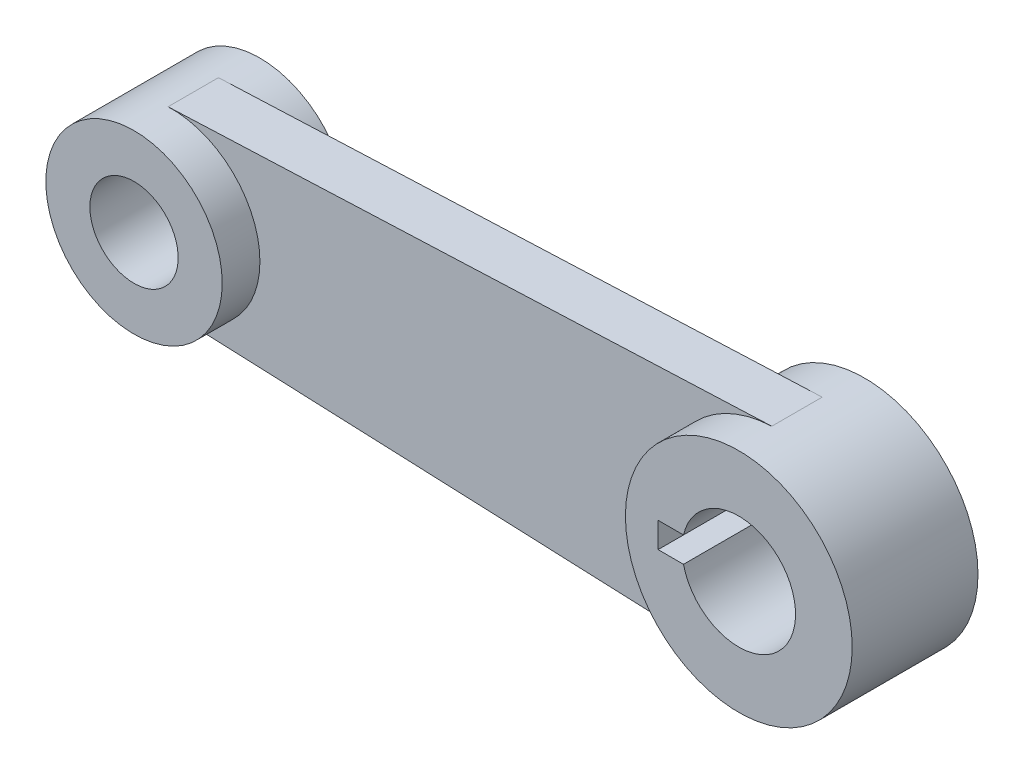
ISO-10303-21;
HEADER;
FILE_DESCRIPTION(('STEP AP214'),'2;1');
FILE_NAME('part.step','',(''),(''),'','','');
FILE_SCHEMA(('AUTOMOTIVE_DESIGN { 1 0 10303 214 1 1 1 1 }'));
ENDSEC;
DATA;
#1=APPLICATION_CONTEXT('core data for automotive mechanical design processes');
#2=APPLICATION_PROTOCOL_DEFINITION('international standard','automotive_design',2000,#1);
#3=PRODUCT_CONTEXT('',#1,'mechanical');
#4=PRODUCT('Part','Part','',(#3));
#5=PRODUCT_RELATED_PRODUCT_CATEGORY('part','',(#4));
#6=PRODUCT_DEFINITION_FORMATION('','',#4);
#7=PRODUCT_DEFINITION_CONTEXT('part definition',#1,'design');
#8=PRODUCT_DEFINITION('design','',#6,#7);
#9=PRODUCT_DEFINITION_SHAPE('','',#8);
#10=(LENGTH_UNIT() NAMED_UNIT(*) SI_UNIT(.MILLI.,.METRE.));
#11=(NAMED_UNIT(*) PLANE_ANGLE_UNIT() SI_UNIT($,.RADIAN.));
#12=(NAMED_UNIT(*) SI_UNIT($,.STERADIAN.) SOLID_ANGLE_UNIT());
#13=UNCERTAINTY_MEASURE_WITH_UNIT(LENGTH_MEASURE(1.E-05),#10,'distance_accuracy_value','');
#14=(GEOMETRIC_REPRESENTATION_CONTEXT(3) GLOBAL_UNCERTAINTY_ASSIGNED_CONTEXT((#13)) GLOBAL_UNIT_ASSIGNED_CONTEXT((#10,
#11,#12)) REPRESENTATION_CONTEXT('',''));
#15=CARTESIAN_POINT('',(0.,0.,0.));
#16=DIRECTION('',(0.,0.,1.));
#17=DIRECTION('',(1.,0.,0.));
#18=AXIS2_PLACEMENT_3D('',#15,#16,#17);
#19=CARTESIAN_POINT('',(-33.6209922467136,-12.897826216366,-3.175));
#20=DIRECTION('',(-0.0416666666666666,-0.999131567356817,0.));
#21=DIRECTION('',(0.999131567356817,-0.0416666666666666,0.));
#22=AXIS2_PLACEMENT_3D('',#19,#20,#21);
#23=PLANE('',#22);
#24=DIRECTION('',(0.999131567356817,-0.0416666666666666,0.));
#25=VECTOR('',#24,1.);
#26=CARTESIAN_POINT('',(-33.6209922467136,-12.897826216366,3.175));
#27=LINE('',#26,#25);
#28=CARTESIAN_POINT('',(-76.6630208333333,-11.1028495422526,3.175));
#29=VERTEX_POINT('',#28);
#30=CARTESIAN_POINT('',(-0.595312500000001,-14.2750922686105,3.175));
#31=VERTEX_POINT('',#30);
#32=EDGE_CURVE('E116',#29,#31,#27,.T.);
#33=ORIENTED_EDGE('',*,*,#32,.F.);
#34=DIRECTION('',(0.,0.,1.));
#35=VECTOR('',#34,1.);
#36=CARTESIAN_POINT('',(-76.6630208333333,-11.1028495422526,-3.175));
#37=LINE('',#36,#35);
#38=CARTESIAN_POINT('',(-76.6630208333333,-11.1028495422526,-3.17499999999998));
#39=VERTEX_POINT('',#38);
#40=EDGE_CURVE('E54',#39,#29,#37,.T.);
#41=ORIENTED_EDGE('',*,*,#40,.F.);
#42=DIRECTION('',(0.999131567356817,-0.0416666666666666,0.));
#43=VECTOR('',#42,1.);
#44=CARTESIAN_POINT('',(-33.6209922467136,-12.897826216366,-3.175));
#45=LINE('',#44,#43);
#46=CARTESIAN_POINT('',(-0.5953125,-14.2750922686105,-3.17499999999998));
#47=VERTEX_POINT('',#46);
#48=EDGE_CURVE('E137',#39,#47,#45,.T.);
#49=ORIENTED_EDGE('',*,*,#48,.T.);
#50=DIRECTION('',(0.,0.,1.));
#51=VECTOR('',#50,1.);
#52=CARTESIAN_POINT('',(-0.5953125,-14.2750922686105,-3.175));
#53=LINE('',#52,#51);
#54=EDGE_CURVE('E14',#47,#31,#53,.T.);
#55=ORIENTED_EDGE('',*,*,#54,.T.);
#56=EDGE_LOOP('',(#33,#41,#49,#55));
#57=FACE_BOUND('',#56,.T.);
#58=ADVANCED_FACE('F45',(#57),#23,.T.);
#59=CARTESIAN_POINT('',(-40.4678532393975,12.612292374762,-3.175));
#60=DIRECTION('',(0.0416666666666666,-0.999131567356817,0.));
#61=DIRECTION('',(0.999131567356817,0.0416666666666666,0.));
#62=AXIS2_PLACEMENT_3D('',#59,#60,#61);
#63=PLANE('',#62);
#64=DIRECTION('',(0.999131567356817,0.0416666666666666,0.));
#65=VECTOR('',#64,1.);
#66=CARTESIAN_POINT('',(-40.4678532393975,12.612292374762,3.175));
#67=LINE('',#66,#65);
#68=CARTESIAN_POINT('',(-76.6630208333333,11.1028495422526,3.175));
#69=VERTEX_POINT('',#68);
#70=CARTESIAN_POINT('',(-0.5953125,14.2750922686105,3.175));
#71=VERTEX_POINT('',#70);
#72=EDGE_CURVE('E117',#69,#71,#67,.T.);
#73=ORIENTED_EDGE('',*,*,#72,.T.);
#74=DIRECTION('',(0.,0.,1.));
#75=VECTOR('',#74,1.);
#76=CARTESIAN_POINT('',(-0.5953125,14.2750922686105,-3.175));
#77=LINE('',#76,#75);
#78=CARTESIAN_POINT('',(-0.5953125,14.2750922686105,-3.17499999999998));
#79=VERTEX_POINT('',#78);
#80=EDGE_CURVE('E49',#79,#71,#77,.T.);
#81=ORIENTED_EDGE('',*,*,#80,.F.);
#82=DIRECTION('',(0.999131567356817,0.0416666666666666,0.));
#83=VECTOR('',#82,1.);
#84=CARTESIAN_POINT('',(-40.4678532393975,12.612292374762,-3.175));
#85=LINE('',#84,#83);
#86=CARTESIAN_POINT('',(-76.6630208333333,11.1028495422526,-3.17499999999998));
#87=VERTEX_POINT('',#86);
#88=EDGE_CURVE('E122',#87,#79,#85,.T.);
#89=ORIENTED_EDGE('',*,*,#88,.F.);
#90=DIRECTION('',(0.,0.,1.));
#91=VECTOR('',#90,1.);
#92=CARTESIAN_POINT('',(-76.6630208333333,11.1028495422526,-3.175));
#93=LINE('',#92,#91);
#94=EDGE_CURVE('E110',#87,#69,#93,.T.);
#95=ORIENTED_EDGE('',*,*,#94,.T.);
#96=EDGE_LOOP('',(#73,#81,#89,#95));
#97=FACE_BOUND('',#96,.T.);
#98=ADVANCED_FACE('F47',(#97),#63,.F.);
#99=CARTESIAN_POINT('',(-36.5125,-82.2337463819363,-3.175));
#100=DIRECTION('',(0.,0.,1.));
#101=DIRECTION('',(1.,0.,0.));
#102=AXIS2_PLACEMENT_3D('',#99,#100,#101);
#103=PLANE('',#102);
#104=CARTESIAN_POINT('',(0.,0.,-3.175));
#105=DIRECTION('',(0.,0.,1.));
#106=DIRECTION('',(1.,0.,0.));
#107=AXIS2_PLACEMENT_3D('',#104,#105,#106);
#108=CIRCLE('',#107,14.2875);
#109=EDGE_CURVE('E132',#47,#79,#108,.F.);
#110=ORIENTED_EDGE('',*,*,#109,.F.);
#111=ORIENTED_EDGE('',*,*,#48,.F.);
#112=CARTESIAN_POINT('',(-76.2,0.,-3.175));
#113=DIRECTION('',(0.,0.,1.));
#114=DIRECTION('',(1.,0.,0.));
#115=AXIS2_PLACEMENT_3D('',#112,#113,#114);
#116=CIRCLE('',#115,11.1125);
#117=EDGE_CURVE('E135',#87,#39,#116,.F.);
#118=ORIENTED_EDGE('',*,*,#117,.F.);
#119=ORIENTED_EDGE('',*,*,#88,.T.);
#120=EDGE_LOOP('',(#110,#111,#118,#119));
#121=FACE_BOUND('',#120,.T.);
#122=ADVANCED_FACE('F144',(#121),#103,.F.);
#123=CARTESIAN_POINT('',(-36.5125,-82.2337463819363,3.175));
#124=DIRECTION('',(0.,0.,1.));
#125=DIRECTION('',(1.,0.,0.));
#126=AXIS2_PLACEMENT_3D('',#123,#124,#125);
#127=PLANE('',#126);
#128=CARTESIAN_POINT('',(0.,0.,3.175));
#129=DIRECTION('',(0.,0.,1.));
#130=DIRECTION('',(1.,0.,0.));
#131=AXIS2_PLACEMENT_3D('',#128,#129,#130);
#132=CIRCLE('',#131,14.2875);
#133=EDGE_CURVE('E125',#31,#71,#132,.F.);
#134=ORIENTED_EDGE('',*,*,#133,.T.);
#135=ORIENTED_EDGE('',*,*,#72,.F.);
#136=CARTESIAN_POINT('',(-76.2,0.,3.175));
#137=DIRECTION('',(0.,0.,1.));
#138=DIRECTION('',(1.,0.,0.));
#139=AXIS2_PLACEMENT_3D('',#136,#137,#138);
#140=CIRCLE('',#139,11.1125);
#141=EDGE_CURVE('E107',#69,#29,#140,.F.);
#142=ORIENTED_EDGE('',*,*,#141,.T.);
#143=ORIENTED_EDGE('',*,*,#32,.T.);
#144=EDGE_LOOP('',(#134,#135,#142,#143));
#145=FACE_BOUND('',#144,.T.);
#146=ADVANCED_FACE('F124',(#145),#127,.T.);
#147=CARTESIAN_POINT('',(0.,0.,53.0857525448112));
#148=DIRECTION('',(0.,0.,-1.));
#149=DIRECTION('',(-1.,0.,0.));
#150=AXIS2_PLACEMENT_3D('',#147,#148,#149);
#151=CYLINDRICAL_SURFACE('',#150,14.2875);
#152=CARTESIAN_POINT('',(0.,0.,-7.9248));
#153=DIRECTION('',(0.,0.,1.));
#154=DIRECTION('',(1.,0.,0.));
#155=AXIS2_PLACEMENT_3D('',#152,#153,#154);
#156=CIRCLE('',#155,14.2875);
#157=CARTESIAN_POINT('',(14.2875,0.,-7.9248));
#158=VERTEX_POINT('',#157);
#159=EDGE_CURVE('E294',#158,#158,#156,.T.);
#160=ORIENTED_EDGE('',*,*,#159,.T.);
#161=EDGE_LOOP('',(#160));
#162=FACE_BOUND('',#161,.T.);
#163=CARTESIAN_POINT('',(0.,0.,7.9248));
#164=DIRECTION('',(0.,0.,1.));
#165=DIRECTION('',(1.,0.,0.));
#166=AXIS2_PLACEMENT_3D('',#163,#164,#165);
#167=CIRCLE('',#166,14.2875);
#168=CARTESIAN_POINT('',(14.2875,0.,7.9248));
#169=VERTEX_POINT('',#168);
#170=EDGE_CURVE('E314',#169,#169,#167,.F.);
#171=ORIENTED_EDGE('',*,*,#170,.T.);
#172=EDGE_LOOP('',(#171));
#173=FACE_BOUND('',#172,.T.);
#174=ORIENTED_EDGE('',*,*,#109,.T.);
#175=ORIENTED_EDGE('',*,*,#80,.T.);
#176=ORIENTED_EDGE('',*,*,#133,.F.);
#177=ORIENTED_EDGE('',*,*,#54,.F.);
#178=EDGE_LOOP('',(#174,#175,#176,#177));
#179=FACE_BOUND('',#178,.T.);
#180=ADVANCED_FACE('F145',(#162,#173,#179),#151,.T.);
#181=CARTESIAN_POINT('',(-10.1691366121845,-82.2337463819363,53.0857525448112));
#182=DIRECTION('',(1.,0.,0.));
#183=DIRECTION('',(0.,0.,-1.));
#184=AXIS2_PLACEMENT_3D('',#181,#182,#183);
#185=PLANE('',#184);
#186=DIRECTION('',(0.,0.,-1.));
#187=VECTOR('',#186,1.);
#188=CARTESIAN_POINT('',(-10.1691366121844,1.6002,53.0857525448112));
#189=LINE('',#188,#187);
#190=CARTESIAN_POINT('',(-10.1691366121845,1.6002,7.9248));
#191=VERTEX_POINT('',#190);
#192=CARTESIAN_POINT('',(-10.1691366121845,1.6002,-7.9248));
#193=VERTEX_POINT('',#192);
#194=EDGE_CURVE('E317',#191,#193,#189,.T.);
#195=ORIENTED_EDGE('',*,*,#194,.F.);
#196=DIRECTION('',(0.,-1.,0.));
#197=VECTOR('',#196,1.);
#198=CARTESIAN_POINT('',(-10.1691366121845,-82.2337463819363,7.9248));
#199=LINE('',#198,#197);
#200=CARTESIAN_POINT('',(-10.1691366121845,-1.6002,7.92480000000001));
#201=VERTEX_POINT('',#200);
#202=EDGE_CURVE('E127',#191,#201,#199,.T.);
#203=ORIENTED_EDGE('',*,*,#202,.T.);
#204=DIRECTION('',(0.,0.,-1.));
#205=VECTOR('',#204,1.);
#206=CARTESIAN_POINT('',(-10.1691366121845,-1.6002,53.0857525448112));
#207=LINE('',#206,#205);
#208=CARTESIAN_POINT('',(-10.1691366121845,-1.6002,-7.9248));
#209=VERTEX_POINT('',#208);
#210=EDGE_CURVE('E319',#201,#209,#207,.T.);
#211=ORIENTED_EDGE('',*,*,#210,.T.);
#212=DIRECTION('',(0.,1.,0.));
#213=VECTOR('',#212,1.);
#214=CARTESIAN_POINT('',(-10.1691366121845,-82.2337463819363,-7.9248));
#215=LINE('',#214,#213);
#216=EDGE_CURVE('E297',#209,#193,#215,.T.);
#217=ORIENTED_EDGE('',*,*,#216,.T.);
#218=EDGE_LOOP('',(#195,#203,#211,#217));
#219=FACE_BOUND('',#218,.T.);
#220=ADVANCED_FACE('F147',(#219),#185,.T.);
#221=CARTESIAN_POINT('',(-36.5125,-1.6002,53.0857525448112));
#222=DIRECTION('',(0.,-1.,0.));
#223=DIRECTION('',(0.,0.,-1.));
#224=AXIS2_PLACEMENT_3D('',#221,#222,#223);
#225=PLANE('',#224);
#226=DIRECTION('',(-1.,0.,0.));
#227=VECTOR('',#226,1.);
#228=CARTESIAN_POINT('',(-36.5125,-1.6002,7.9248));
#229=LINE('',#228,#227);
#230=CARTESIAN_POINT('',(-6.96873661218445,-1.6002,7.9248));
#231=VERTEX_POINT('',#230);
#232=EDGE_CURVE('E301',#231,#201,#229,.T.);
#233=ORIENTED_EDGE('',*,*,#232,.F.);
#234=DIRECTION('',(0.,0.,-1.));
#235=VECTOR('',#234,1.);
#236=CARTESIAN_POINT('',(-6.96873661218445,-1.6002,53.0857525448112));
#237=LINE('',#236,#235);
#238=CARTESIAN_POINT('',(-6.96873661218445,-1.6002,-7.92480000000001));
#239=VERTEX_POINT('',#238);
#240=EDGE_CURVE('E321',#231,#239,#237,.T.);
#241=ORIENTED_EDGE('',*,*,#240,.T.);
#242=DIRECTION('',(1.,0.,0.));
#243=VECTOR('',#242,1.);
#244=CARTESIAN_POINT('',(-36.5125,-1.6002,-7.9248));
#245=LINE('',#244,#243);
#246=EDGE_CURVE('E296',#209,#239,#245,.T.);
#247=ORIENTED_EDGE('',*,*,#246,.F.);
#248=ORIENTED_EDGE('',*,*,#210,.F.);
#249=EDGE_LOOP('',(#233,#241,#247,#248));
#250=FACE_BOUND('',#249,.T.);
#251=ADVANCED_FACE('F154',(#250),#225,.F.);
#252=CARTESIAN_POINT('',(0.,0.,53.0857525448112));
#253=DIRECTION('',(0.,0.,-1.));
#254=DIRECTION('',(-1.,0.,0.));
#255=AXIS2_PLACEMENT_3D('',#252,#253,#254);
#256=CYLINDRICAL_SURFACE('',#255,7.1501);
#257=CARTESIAN_POINT('',(0.,0.,7.9248));
#258=DIRECTION('',(0.,0.,1.));
#259=DIRECTION('',(1.,0.,0.));
#260=AXIS2_PLACEMENT_3D('',#257,#258,#259);
#261=CIRCLE('',#260,7.1501);
#262=CARTESIAN_POINT('',(-6.96873661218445,1.6002,7.9248));
#263=VERTEX_POINT('',#262);
#264=EDGE_CURVE('E309',#263,#231,#261,.F.);
#265=ORIENTED_EDGE('',*,*,#264,.F.);
#266=DIRECTION('',(0.,0.,-1.));
#267=VECTOR('',#266,1.);
#268=CARTESIAN_POINT('',(-6.96873661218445,1.6002,53.0857525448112));
#269=LINE('',#268,#267);
#270=CARTESIAN_POINT('',(-6.96873661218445,1.6002,-7.9248));
#271=VERTEX_POINT('',#270);
#272=EDGE_CURVE('E323',#263,#271,#269,.T.);
#273=ORIENTED_EDGE('',*,*,#272,.T.);
#274=CARTESIAN_POINT('',(0.,0.,-7.9248));
#275=DIRECTION('',(0.,0.,1.));
#276=DIRECTION('',(1.,0.,0.));
#277=AXIS2_PLACEMENT_3D('',#274,#275,#276);
#278=CIRCLE('',#277,7.1501);
#279=EDGE_CURVE('E298',#239,#271,#278,.T.);
#280=ORIENTED_EDGE('',*,*,#279,.F.);
#281=ORIENTED_EDGE('',*,*,#240,.F.);
#282=EDGE_LOOP('',(#265,#273,#280,#281));
#283=FACE_BOUND('',#282,.T.);
#284=ADVANCED_FACE('F195',(#283),#256,.F.);
#285=CARTESIAN_POINT('',(-36.5125,1.6002,53.0857525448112));
#286=DIRECTION('',(0.,-1.,0.));
#287=DIRECTION('',(0.,0.,-1.));
#288=AXIS2_PLACEMENT_3D('',#285,#286,#287);
#289=PLANE('',#288);
#290=ORIENTED_EDGE('',*,*,#272,.F.);
#291=DIRECTION('',(-1.,0.,0.));
#292=VECTOR('',#291,1.);
#293=CARTESIAN_POINT('',(-36.5125,1.6002,7.9248));
#294=LINE('',#293,#292);
#295=EDGE_CURVE('E311',#263,#191,#294,.T.);
#296=ORIENTED_EDGE('',*,*,#295,.T.);
#297=ORIENTED_EDGE('',*,*,#194,.T.);
#298=DIRECTION('',(1.,0.,0.));
#299=VECTOR('',#298,1.);
#300=CARTESIAN_POINT('',(-36.5125,1.6002,-7.9248));
#301=LINE('',#300,#299);
#302=EDGE_CURVE('E292',#193,#271,#301,.T.);
#303=ORIENTED_EDGE('',*,*,#302,.T.);
#304=EDGE_LOOP('',(#290,#296,#297,#303));
#305=FACE_BOUND('',#304,.T.);
#306=ADVANCED_FACE('F205',(#305),#289,.T.);
#307=CARTESIAN_POINT('',(-36.5125,-82.2337463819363,7.9248));
#308=DIRECTION('',(0.,0.,1.));
#309=DIRECTION('',(1.,0.,0.));
#310=AXIS2_PLACEMENT_3D('',#307,#308,#309);
#311=PLANE('',#310);
#312=ORIENTED_EDGE('',*,*,#170,.F.);
#313=EDGE_LOOP('',(#312));
#314=FACE_BOUND('',#313,.T.);
#315=ORIENTED_EDGE('',*,*,#295,.F.);
#316=ORIENTED_EDGE('',*,*,#264,.T.);
#317=ORIENTED_EDGE('',*,*,#232,.T.);
#318=ORIENTED_EDGE('',*,*,#202,.F.);
#319=EDGE_LOOP('',(#315,#316,#317,#318));
#320=FACE_BOUND('',#319,.T.);
#321=ADVANCED_FACE('F215',(#314,#320),#311,.T.);
#322=CARTESIAN_POINT('',(-36.5125,-82.2337463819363,-7.9248));
#323=DIRECTION('',(0.,0.,1.));
#324=DIRECTION('',(1.,0.,0.));
#325=AXIS2_PLACEMENT_3D('',#322,#323,#324);
#326=PLANE('',#325);
#327=ORIENTED_EDGE('',*,*,#216,.F.);
#328=ORIENTED_EDGE('',*,*,#246,.T.);
#329=ORIENTED_EDGE('',*,*,#279,.T.);
#330=ORIENTED_EDGE('',*,*,#302,.F.);
#331=EDGE_LOOP('',(#327,#328,#329,#330));
#332=FACE_BOUND('',#331,.T.);
#333=ORIENTED_EDGE('',*,*,#159,.F.);
#334=EDGE_LOOP('',(#333));
#335=FACE_BOUND('',#334,.T.);
#336=ADVANCED_FACE('F224',(#332,#335),#326,.F.);
#337=CARTESIAN_POINT('',(-76.2,0.,53.0857525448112));
#338=DIRECTION('',(0.,0.,-1.));
#339=DIRECTION('',(-1.,0.,0.));
#340=AXIS2_PLACEMENT_3D('',#337,#338,#339);
#341=CYLINDRICAL_SURFACE('',#340,11.1125);
#342=CARTESIAN_POINT('',(-76.2,0.,-7.9248));
#343=DIRECTION('',(0.,0.,1.));
#344=DIRECTION('',(1.,0.,0.));
#345=AXIS2_PLACEMENT_3D('',#342,#343,#344);
#346=CIRCLE('',#345,11.1125);
#347=CARTESIAN_POINT('',(-65.0875,0.,-7.9248));
#348=VERTEX_POINT('',#347);
#349=EDGE_CURVE('E283',#348,#348,#346,.T.);
#350=ORIENTED_EDGE('',*,*,#349,.T.);
#351=EDGE_LOOP('',(#350));
#352=FACE_BOUND('',#351,.T.);
#353=CARTESIAN_POINT('',(-76.2,0.,7.9248));
#354=DIRECTION('',(0.,0.,1.));
#355=DIRECTION('',(1.,0.,0.));
#356=AXIS2_PLACEMENT_3D('',#353,#354,#355);
#357=CIRCLE('',#356,11.1125);
#358=CARTESIAN_POINT('',(-65.0875,0.,7.9248));
#359=VERTEX_POINT('',#358);
#360=EDGE_CURVE('E284',#359,#359,#357,.F.);
#361=ORIENTED_EDGE('',*,*,#360,.T.);
#362=EDGE_LOOP('',(#361));
#363=FACE_BOUND('',#362,.T.);
#364=ORIENTED_EDGE('',*,*,#117,.T.);
#365=ORIENTED_EDGE('',*,*,#40,.T.);
#366=ORIENTED_EDGE('',*,*,#141,.F.);
#367=ORIENTED_EDGE('',*,*,#94,.F.);
#368=EDGE_LOOP('',(#364,#365,#366,#367));
#369=FACE_BOUND('',#368,.T.);
#370=ADVANCED_FACE('F109',(#352,#363,#369),#341,.T.);
#371=CARTESIAN_POINT('',(-76.2,0.,53.0857525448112));
#372=DIRECTION('',(0.,0.,-1.));
#373=DIRECTION('',(-1.,0.,0.));
#374=AXIS2_PLACEMENT_3D('',#371,#372,#373);
#375=CYLINDRICAL_SURFACE('',#374,5.5626);
#376=CARTESIAN_POINT('',(-76.2,0.,7.9248));
#377=DIRECTION('',(0.,0.,1.));
#378=DIRECTION('',(1.,0.,0.));
#379=AXIS2_PLACEMENT_3D('',#376,#377,#378);
#380=CIRCLE('',#379,5.5626);
#381=CARTESIAN_POINT('',(-81.7626,0.,7.92479999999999));
#382=VERTEX_POINT('',#381);
#383=EDGE_CURVE('E287',#382,#382,#380,.F.);
#384=CARTESIAN_POINT('',(-76.2,0.,-7.9248));
#385=DIRECTION('',(0.,0.,1.));
#386=DIRECTION('',(1.,0.,0.));
#387=AXIS2_PLACEMENT_3D('',#384,#385,#386);
#388=CIRCLE('',#387,5.5626);
#389=CARTESIAN_POINT('',(-81.7626,0.,-7.9248));
#390=VERTEX_POINT('',#389);
#391=EDGE_CURVE('E280',#390,#390,#388,.T.);
#392=CARTESIAN_POINT('',(-81.7626,0.,7.92479999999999));
#393=CARTESIAN_POINT('',(-81.7626,0.,7.75969999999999));
#394=CARTESIAN_POINT('',(-81.7626,0.,7.59459999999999));
#395=CARTESIAN_POINT('',(-81.7626,0.,7.26439999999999));
#396=CARTESIAN_POINT('',(-81.7626,0.,7.09929999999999));
#397=CARTESIAN_POINT('',(-81.7626,0.,6.76909999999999));
#398=CARTESIAN_POINT('',(-81.7626,0.,6.60399999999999));
#399=CARTESIAN_POINT('',(-81.7626,0.,6.27379999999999));
#400=CARTESIAN_POINT('',(-81.7626,0.,6.10869999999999));
#401=CARTESIAN_POINT('',(-81.7626,0.,5.77849999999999));
#402=CARTESIAN_POINT('',(-81.7626,0.,5.61339999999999));
#403=CARTESIAN_POINT('',(-81.7626,0.,5.28319999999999));
#404=CARTESIAN_POINT('',(-81.7626,0.,5.11809999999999));
#405=CARTESIAN_POINT('',(-81.7626,0.,4.78789999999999));
#406=CARTESIAN_POINT('',(-81.7626,0.,4.62279999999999));
#407=CARTESIAN_POINT('',(-81.7626,0.,4.29259999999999));
#408=CARTESIAN_POINT('',(-81.7626,0.,4.12749999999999));
#409=CARTESIAN_POINT('',(-81.7626,0.,3.79729999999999));
#410=CARTESIAN_POINT('',(-81.7626,0.,3.63219999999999));
#411=CARTESIAN_POINT('',(-81.7626,0.,3.30199999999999));
#412=CARTESIAN_POINT('',(-81.7626,0.,3.13689999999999));
#413=CARTESIAN_POINT('',(-81.7626,0.,2.80669999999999));
#414=CARTESIAN_POINT('',(-81.7626,0.,2.64159999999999));
#415=CARTESIAN_POINT('',(-81.7626,0.,2.31139999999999));
#416=CARTESIAN_POINT('',(-81.7626,0.,2.14629999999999));
#417=CARTESIAN_POINT('',(-81.7626,0.,1.81609999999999));
#418=CARTESIAN_POINT('',(-81.7626,0.,1.65099999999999));
#419=CARTESIAN_POINT('',(-81.7626,0.,1.32079999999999));
#420=CARTESIAN_POINT('',(-81.7626,0.,1.15569999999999));
#421=CARTESIAN_POINT('',(-81.7626,0.,0.825499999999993));
#422=CARTESIAN_POINT('',(-81.7626,0.,0.660399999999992));
#423=CARTESIAN_POINT('',(-81.7626,0.,0.330199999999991));
#424=CARTESIAN_POINT('',(-81.7626,0.,0.165099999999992));
#425=CARTESIAN_POINT('',(-81.7626,0.,-0.165100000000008));
#426=CARTESIAN_POINT('',(-81.7626,0.,-0.33020000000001));
#427=CARTESIAN_POINT('',(-81.7626,0.,-0.66040000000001));
#428=CARTESIAN_POINT('',(-81.7626,0.,-0.825500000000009));
#429=CARTESIAN_POINT('',(-81.7626,0.,-1.15570000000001));
#430=CARTESIAN_POINT('',(-81.7626,0.,-1.32080000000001));
#431=CARTESIAN_POINT('',(-81.7626,0.,-1.65100000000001));
#432=CARTESIAN_POINT('',(-81.7626,0.,-1.81610000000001));
#433=CARTESIAN_POINT('',(-81.7626,0.,-2.14630000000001));
#434=CARTESIAN_POINT('',(-81.7626,0.,-2.31140000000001));
#435=CARTESIAN_POINT('',(-81.7626,0.,-2.64160000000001));
#436=CARTESIAN_POINT('',(-81.7626,0.,-2.8067));
#437=CARTESIAN_POINT('',(-81.7626,0.,-3.13690000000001));
#438=CARTESIAN_POINT('',(-81.7626,0.,-3.30200000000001));
#439=CARTESIAN_POINT('',(-81.7626,0.,-3.63220000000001));
#440=CARTESIAN_POINT('',(-81.7626,0.,-3.79730000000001));
#441=CARTESIAN_POINT('',(-81.7626,0.,-4.1275));
#442=CARTESIAN_POINT('',(-81.7626,0.,-4.2926));
#443=CARTESIAN_POINT('',(-81.7626,0.,-4.6228));
#444=CARTESIAN_POINT('',(-81.7626,0.,-4.7879));
#445=CARTESIAN_POINT('',(-81.7626,0.,-5.1181));
#446=CARTESIAN_POINT('',(-81.7626,0.,-5.2832));
#447=CARTESIAN_POINT('',(-81.7626,0.,-5.6134));
#448=CARTESIAN_POINT('',(-81.7626,0.,-5.7785));
#449=CARTESIAN_POINT('',(-81.7626,0.,-6.1087));
#450=CARTESIAN_POINT('',(-81.7626,0.,-6.2738));
#451=CARTESIAN_POINT('',(-81.7626,0.,-6.604));
#452=CARTESIAN_POINT('',(-81.7626,0.,-6.7691));
#453=CARTESIAN_POINT('',(-81.7626,0.,-7.0993));
#454=CARTESIAN_POINT('',(-81.7626,0.,-7.2644));
#455=CARTESIAN_POINT('',(-81.7626,0.,-7.5946));
#456=CARTESIAN_POINT('',(-81.7626,0.,-7.7597));
#457=CARTESIAN_POINT('',(-81.7626,0.,-7.9248));
#458=B_SPLINE_CURVE_WITH_KNOTS('',3,(#392,#393,#394,#395,#396,#397,#398,#399,#400,#401,#402,
#403,#404,#405,#406,#407,#408,#409,#410,#411,#412,#413,#414,#415,#416,#417,#418,#419,#420,#421,
#422,#423,#424,#425,#426,#427,#428,#429,#430,#431,#432,#433,#434,#435,#436,#437,#438,#439,#440,
#441,#442,#443,#444,#445,#446,#447,#448,#449,#450,#451,#452,#453,#454,#455,#456,#457),
.UNSPECIFIED.,.F.,.F.,(4,2,2,2,2,2,2,2,2,2,2,2,2,2,2,2,2,2,2,2,2,2,2,2,2,2,2,2,2,2,2,2,4),(0.,
0.495299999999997,0.990600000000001,1.4859,1.9812,2.4765,2.9718,3.4671,3.9624,4.45769999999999,
4.953,5.4483,5.94359999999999,6.4389,6.93419999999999,7.4295,7.9248,8.4201,8.9154,
9.41069999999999,9.906,10.4013,10.8966,11.3919,11.8872,12.3825,12.8778,13.3731,13.8684,14.3637,
14.859,15.3543,15.8496),.UNSPECIFIED.);
#459=EDGE_CURVE('BSEAM243',#382,#390,#458,.T.);
#460=ORIENTED_EDGE('',*,*,#383,.F.);
#461=ORIENTED_EDGE('',*,*,#391,.F.);
#462=ORIENTED_EDGE('',*,*,#459,.T.);
#463=ORIENTED_EDGE('',*,*,#459,.F.);
#464=EDGE_LOOP('',(#460,#462,#461,#463));
#465=FACE_BOUND('',#464,.T.);
#466=ADVANCED_FACE('F243',(#465),#375,.F.);
#467=CARTESIAN_POINT('',(-36.5125,-82.2337463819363,7.9248));
#468=DIRECTION('',(0.,0.,1.));
#469=DIRECTION('',(1.,0.,0.));
#470=AXIS2_PLACEMENT_3D('',#467,#468,#469);
#471=PLANE('',#470);
#472=ORIENTED_EDGE('',*,*,#360,.F.);
#473=EDGE_LOOP('',(#472));
#474=FACE_BOUND('',#473,.T.);
#475=ORIENTED_EDGE('',*,*,#383,.T.);
#476=EDGE_LOOP('',(#475));
#477=FACE_BOUND('',#476,.T.);
#478=ADVANCED_FACE('F253',(#474,#477),#471,.T.);
#479=CARTESIAN_POINT('',(-36.5125,-82.2337463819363,-7.9248));
#480=DIRECTION('',(0.,0.,1.));
#481=DIRECTION('',(1.,0.,0.));
#482=AXIS2_PLACEMENT_3D('',#479,#480,#481);
#483=PLANE('',#482);
#484=ORIENTED_EDGE('',*,*,#391,.T.);
#485=EDGE_LOOP('',(#484));
#486=FACE_BOUND('',#485,.T.);
#487=ORIENTED_EDGE('',*,*,#349,.F.);
#488=EDGE_LOOP('',(#487));
#489=FACE_BOUND('',#488,.T.);
#490=ADVANCED_FACE('F263',(#486,#489),#483,.F.);
#491=CLOSED_SHELL('',(#58,#98,#122,#146,#180,#220,#251,#284,#306,#321,#336,#370,#466,#478,#490));
#492=MANIFOLD_SOLID_BREP('B2',#491);
#493=ADVANCED_BREP_SHAPE_REPRESENTATION('',(#18,#492),#14);
#494=SHAPE_DEFINITION_REPRESENTATION(#9,#493);
ENDSEC;
END-ISO-10303-21;
